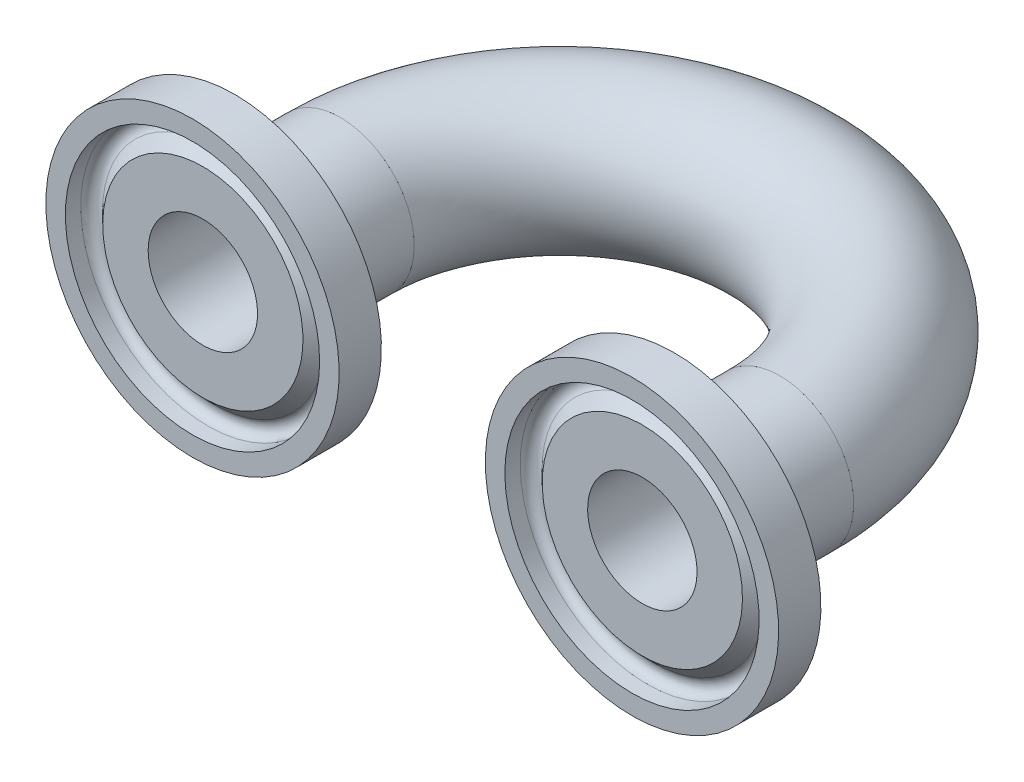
ISO-10303-21;
HEADER;
FILE_DESCRIPTION(('STEP AP214'),'2;1');
FILE_NAME('part.step','',(''),(''),'','','');
FILE_SCHEMA(('AUTOMOTIVE_DESIGN { 1 0 10303 214 1 1 1 1 }'));
ENDSEC;
DATA;
#1=APPLICATION_CONTEXT('core data for automotive mechanical design processes');
#2=APPLICATION_PROTOCOL_DEFINITION('international standard','automotive_design',2000,#1);
#3=PRODUCT_CONTEXT('',#1,'mechanical');
#4=PRODUCT('Part','Part','',(#3));
#5=PRODUCT_RELATED_PRODUCT_CATEGORY('part','',(#4));
#6=PRODUCT_DEFINITION_FORMATION('','',#4);
#7=PRODUCT_DEFINITION_CONTEXT('part definition',#1,'design');
#8=PRODUCT_DEFINITION('design','',#6,#7);
#9=PRODUCT_DEFINITION_SHAPE('','',#8);
#10=(LENGTH_UNIT() NAMED_UNIT(*) SI_UNIT(.MILLI.,.METRE.));
#11=(NAMED_UNIT(*) PLANE_ANGLE_UNIT() SI_UNIT($,.RADIAN.));
#12=(NAMED_UNIT(*) SI_UNIT($,.STERADIAN.) SOLID_ANGLE_UNIT());
#13=UNCERTAINTY_MEASURE_WITH_UNIT(LENGTH_MEASURE(1.E-05),#10,'distance_accuracy_value','');
#14=(GEOMETRIC_REPRESENTATION_CONTEXT(3) GLOBAL_UNCERTAINTY_ASSIGNED_CONTEXT((#13)) GLOBAL_UNIT_ASSIGNED_CONTEXT((#10,
#11,#12)) REPRESENTATION_CONTEXT('',''));
#15=CARTESIAN_POINT('',(0.,0.,0.));
#16=DIRECTION('',(0.,0.,1.));
#17=DIRECTION('',(1.,0.,0.));
#18=AXIS2_PLACEMENT_3D('',#15,#16,#17);
#19=CARTESIAN_POINT('',(33.8741369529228,21.8472242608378,46.9912731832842));
#20=DIRECTION('',(0.,0.,1.));
#21=DIRECTION('',(0.313968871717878,-0.949433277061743,0.));
#22=AXIS2_PLACEMENT_3D('',#19,#20,#21);
#23=CYLINDRICAL_SURFACE('',#22,10.922);
#24=CARTESIAN_POINT('',(33.8741369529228,21.8472242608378,45.6704731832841));
#25=DIRECTION('',(0.,0.,1.));
#26=DIRECTION('',(0.313968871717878,-0.949433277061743,0.));
#27=AXIS2_PLACEMENT_3D('',#24,#25,#26);
#28=CIRCLE('',#27,10.922);
#29=CARTESIAN_POINT('',(37.3033049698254,11.4775140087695,45.6704731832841));
#30=VERTEX_POINT('',#29);
#31=EDGE_CURVE('P0_E9',#30,#30,#28,.T.);
#32=ORIENTED_EDGE('',*,*,#31,.F.);
#33=EDGE_LOOP('',(#32));
#34=FACE_BOUND('',#33,.T.);
#35=CARTESIAN_POINT('',(33.8741369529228,21.8472242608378,46.9912731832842));
#36=DIRECTION('',(0.,0.,1.));
#37=DIRECTION('',(0.313968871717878,-0.949433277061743,0.));
#38=AXIS2_PLACEMENT_3D('',#35,#36,#37);
#39=CIRCLE('',#38,10.922);
#40=CARTESIAN_POINT('',(37.3033049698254,11.4775140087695,46.9912731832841));
#41=VERTEX_POINT('',#40);
#42=EDGE_CURVE('P0_E48',#41,#41,#39,.T.);
#43=ORIENTED_EDGE('',*,*,#42,.T.);
#44=EDGE_LOOP('',(#43));
#45=FACE_BOUND('',#44,.T.);
#46=ADVANCED_FACE('P0_F14',(#34,#45),#23,.F.);
#47=CARTESIAN_POINT('',(33.8741369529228,21.8472242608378,45.6704731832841));
#48=DIRECTION('',(0.,0.,1.));
#49=DIRECTION('',(0.313968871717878,-0.949433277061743,0.));
#50=AXIS2_PLACEMENT_3D('',#47,#48,#49);
#51=TOROIDAL_SURFACE('',#50,10.1473,0.7747);
#52=CARTESIAN_POINT('',(33.8741369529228,21.8472242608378,45.1382742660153));
#53=DIRECTION('',(0.,0.,1.));
#54=DIRECTION('',(0.313968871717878,-0.949433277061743,0.));
#55=AXIS2_PLACEMENT_3D('',#52,#53,#54);
#56=CIRCLE('',#55,9.58433960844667);
#57=CARTESIAN_POINT('',(36.8833212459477,12.7475332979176,45.1382742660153));
#58=VERTEX_POINT('',#57);
#59=EDGE_CURVE('P0_E20',#58,#58,#56,.T.);
#60=ORIENTED_EDGE('',*,*,#59,.F.);
#61=EDGE_LOOP('',(#60));
#62=FACE_BOUND('',#61,.T.);
#63=ORIENTED_EDGE('',*,*,#31,.T.);
#64=EDGE_LOOP('',(#63));
#65=FACE_BOUND('',#64,.T.);
#66=ADVANCED_FACE('P0_F97',(#62,#65),#51,.F.);
#67=CARTESIAN_POINT('',(33.8741369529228,21.8472242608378,45.1382742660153));
#68=DIRECTION('',(0.,0.,-1.));
#69=DIRECTION('',(-0.313968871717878,0.949433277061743,0.));
#70=AXIS2_PLACEMENT_3D('',#67,#68,#69);
#71=CONICAL_SURFACE('',#70,9.58433960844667,0.794623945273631);
#72=CARTESIAN_POINT('',(33.8741369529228,21.8472242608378,46.1022731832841));
#73=DIRECTION('',(0.,0.,1.));
#74=DIRECTION('',(0.313968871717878,-0.949433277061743,0.));
#75=AXIS2_PLACEMENT_3D('',#72,#73,#74);
#76=CIRCLE('',#75,8.60238725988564);
#77=CARTESIAN_POINT('',(36.5750187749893,13.6798315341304,46.1022731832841));
#78=VERTEX_POINT('',#77);
#79=EDGE_CURVE('P0_E24',#78,#78,#76,.T.);
#80=ORIENTED_EDGE('',*,*,#79,.F.);
#81=EDGE_LOOP('',(#80));
#82=FACE_BOUND('',#81,.T.);
#83=ORIENTED_EDGE('',*,*,#59,.T.);
#84=EDGE_LOOP('',(#83));
#85=FACE_BOUND('',#84,.T.);
#86=ADVANCED_FACE('P0_F92',(#82,#85),#71,.T.);
#87=CARTESIAN_POINT('',(25.7067442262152,19.1463424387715,46.1022731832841));
#88=DIRECTION('',(0.,0.,-1.));
#89=DIRECTION('',(-0.313968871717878,0.949433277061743,0.));
#90=AXIS2_PLACEMENT_3D('',#87,#88,#89);
#91=PLANE('',#90);
#92=CARTESIAN_POINT('',(33.8741369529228,21.8472242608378,46.1022731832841));
#93=DIRECTION('',(0.,0.,1.));
#94=DIRECTION('',(0.313968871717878,-0.949433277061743,0.));
#95=AXIS2_PLACEMENT_3D('',#92,#93,#94);
#96=CIRCLE('',#95,4.699);
#97=CARTESIAN_POINT('',(35.3494766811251,17.3858372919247,46.1022731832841));
#98=VERTEX_POINT('',#97);
#99=EDGE_CURVE('P0_E28',#98,#98,#96,.T.);
#100=ORIENTED_EDGE('',*,*,#99,.F.);
#101=EDGE_LOOP('',(#100));
#102=FACE_BOUND('',#101,.T.);
#103=ORIENTED_EDGE('',*,*,#79,.T.);
#104=EDGE_LOOP('',(#103));
#105=FACE_BOUND('',#104,.T.);
#106=ADVANCED_FACE('P0_F86',(#102,#105),#91,.F.);
#107=CARTESIAN_POINT('',(33.8741369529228,21.8472242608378,46.9912731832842));
#108=DIRECTION('',(0.,0.,1.));
#109=DIRECTION('',(0.313968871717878,-0.949433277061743,0.));
#110=AXIS2_PLACEMENT_3D('',#107,#108,#109);
#111=CYLINDRICAL_SURFACE('',#110,4.699);
#112=CARTESIAN_POINT('',(33.8741369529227,21.8472242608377,34.2912731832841));
#113=DIRECTION('',(0.,0.,1.));
#114=DIRECTION('',(0.313968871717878,-0.949433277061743,0.));
#115=AXIS2_PLACEMENT_3D('',#112,#113,#114);
#116=CIRCLE('',#115,4.699);
#117=CARTESIAN_POINT('',(35.349476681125,17.3858372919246,34.2912731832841));
#118=VERTEX_POINT('',#117);
#119=EDGE_CURVE('P0_E33',#118,#118,#116,.T.);
#120=ORIENTED_EDGE('',*,*,#119,.F.);
#121=EDGE_LOOP('',(#120));
#122=FACE_BOUND('',#121,.T.);
#123=ORIENTED_EDGE('',*,*,#99,.T.);
#124=EDGE_LOOP('',(#123));
#125=FACE_BOUND('',#124,.T.);
#126=ADVANCED_FACE('P0_F80',(#122,#125),#111,.F.);
#127=CARTESIAN_POINT('',(29.4127499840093,20.3718845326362,34.2912731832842));
#128=DIRECTION('',(0.,0.,1.));
#129=DIRECTION('',(0.313968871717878,-0.949433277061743,0.));
#130=AXIS2_PLACEMENT_3D('',#127,#128,#129);
#131=PLANE('',#130);
#132=CARTESIAN_POINT('',(33.8741369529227,21.8472242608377,34.2912731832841));
#133=DIRECTION('',(0.,0.,1.));
#134=DIRECTION('',(0.313968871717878,-0.949433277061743,0.));
#135=AXIS2_PLACEMENT_3D('',#132,#133,#134);
#136=CIRCLE('',#135,6.35);
#137=CARTESIAN_POINT('',(35.8678392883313,15.8183229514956,34.2912731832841));
#138=VERTEX_POINT('',#137);
#139=EDGE_CURVE('P0_E36',#138,#138,#136,.T.);
#140=ORIENTED_EDGE('',*,*,#139,.F.);
#141=EDGE_LOOP('',(#140));
#142=FACE_BOUND('',#141,.T.);
#143=ORIENTED_EDGE('',*,*,#119,.T.);
#144=EDGE_LOOP('',(#143));
#145=FACE_BOUND('',#144,.T.);
#146=ADVANCED_FACE('P0_F74',(#142,#145),#131,.F.);
#147=CARTESIAN_POINT('',(33.8741369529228,21.8472242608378,46.9912731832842));
#148=DIRECTION('',(0.,0.,1.));
#149=DIRECTION('',(0.313968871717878,-0.949433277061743,0.));
#150=AXIS2_PLACEMENT_3D('',#147,#148,#149);
#151=CYLINDRICAL_SURFACE('',#150,6.35);
#152=CARTESIAN_POINT('',(33.8741369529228,21.8472242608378,41.0848415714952));
#153=DIRECTION('',(0.,0.,1.));
#154=DIRECTION('',(0.313968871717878,-0.949433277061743,0.));
#155=AXIS2_PLACEMENT_3D('',#152,#153,#154);
#156=CIRCLE('',#155,6.35);
#157=CARTESIAN_POINT('',(35.8678392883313,15.8183229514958,41.0848415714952));
#158=VERTEX_POINT('',#157);
#159=EDGE_CURVE('P0_E39',#158,#158,#156,.T.);
#160=ORIENTED_EDGE('',*,*,#159,.F.);
#161=EDGE_LOOP('',(#160));
#162=FACE_BOUND('',#161,.T.);
#163=ORIENTED_EDGE('',*,*,#139,.T.);
#164=EDGE_LOOP('',(#163));
#165=FACE_BOUND('',#164,.T.);
#166=ADVANCED_FACE('P0_F68',(#162,#165),#151,.T.);
#167=CARTESIAN_POINT('',(33.8741369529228,21.8472242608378,41.0848415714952));
#168=DIRECTION('',(0.,0.,1.));
#169=DIRECTION('',(0.313968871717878,-0.949433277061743,0.));
#170=AXIS2_PLACEMENT_3D('',#167,#168,#169);
#171=CONICAL_SURFACE('',#170,6.35,1.22173047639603);
#172=CARTESIAN_POINT('',(33.8741369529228,21.8472242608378,43.3590731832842));
#173=DIRECTION('',(0.,0.,1.));
#174=DIRECTION('',(0.313968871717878,-0.949433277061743,0.));
#175=AXIS2_PLACEMENT_3D('',#172,#173,#174);
#176=CIRCLE('',#175,12.5984);
#177=CARTESIAN_POINT('',(37.8296423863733,9.88588406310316,43.3590731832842));
#178=VERTEX_POINT('',#177);
#179=EDGE_CURVE('P0_E42',#178,#178,#176,.T.);
#180=ORIENTED_EDGE('',*,*,#179,.F.);
#181=EDGE_LOOP('',(#180));
#182=FACE_BOUND('',#181,.T.);
#183=ORIENTED_EDGE('',*,*,#159,.T.);
#184=EDGE_LOOP('',(#183));
#185=FACE_BOUND('',#184,.T.);
#186=ADVANCED_FACE('P0_F62',(#182,#185),#171,.T.);
#187=CARTESIAN_POINT('',(33.8741369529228,21.8472242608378,46.9912731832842));
#188=DIRECTION('',(0.,0.,1.));
#189=DIRECTION('',(0.313968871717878,-0.949433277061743,0.));
#190=AXIS2_PLACEMENT_3D('',#187,#188,#189);
#191=CYLINDRICAL_SURFACE('',#190,12.5984);
#192=CARTESIAN_POINT('',(33.8741369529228,21.8472242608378,46.9912731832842));
#193=DIRECTION('',(0.,0.,1.));
#194=DIRECTION('',(0.313968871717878,-0.949433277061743,0.));
#195=AXIS2_PLACEMENT_3D('',#192,#193,#194);
#196=CIRCLE('',#195,12.5984);
#197=CARTESIAN_POINT('',(37.8296423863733,9.88588406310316,46.9912731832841));
#198=VERTEX_POINT('',#197);
#199=EDGE_CURVE('P0_E45',#198,#198,#196,.T.);
#200=ORIENTED_EDGE('',*,*,#199,.F.);
#201=EDGE_LOOP('',(#200));
#202=FACE_BOUND('',#201,.T.);
#203=ORIENTED_EDGE('',*,*,#179,.T.);
#204=EDGE_LOOP('',(#203));
#205=FACE_BOUND('',#204,.T.);
#206=ADVANCED_FACE('P0_F56',(#202,#205),#191,.T.);
#207=CARTESIAN_POINT('',(21.912796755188,17.8917188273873,46.9912731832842));
#208=DIRECTION('',(0.,0.,-1.));
#209=DIRECTION('',(-0.313968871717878,0.949433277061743,0.));
#210=AXIS2_PLACEMENT_3D('',#207,#208,#209);
#211=PLANE('',#210);
#212=ORIENTED_EDGE('',*,*,#42,.F.);
#213=EDGE_LOOP('',(#212));
#214=FACE_BOUND('',#213,.T.);
#215=ORIENTED_EDGE('',*,*,#199,.T.);
#216=EDGE_LOOP('',(#215));
#217=FACE_BOUND('',#216,.T.);
#218=ADVANCED_FACE('P0_F53',(#214,#217),#211,.F.);
#219=CLOSED_SHELL('',(#46,#66,#86,#106,#126,#146,#166,#186,#206,#218));
#220=MANIFOLD_SOLID_BREP('P0_B1',#219);
#221=CARTESIAN_POINT('',(-4.22433670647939,21.8472242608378,46.6502382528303));
#222=DIRECTION('',(0.,0.,1.));
#223=DIRECTION('',(0.84551655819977,-0.533949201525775,0.));
#224=AXIS2_PLACEMENT_3D('',#221,#222,#223);
#225=CYLINDRICAL_SURFACE('',#224,10.922);
#226=CARTESIAN_POINT('',(-4.22433670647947,21.8472242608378,45.3294382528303));
#227=DIRECTION('',(0.,0.,1.));
#228=DIRECTION('',(0.84551655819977,-0.533949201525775,0.));
#229=AXIS2_PLACEMENT_3D('',#226,#227,#228);
#230=CIRCLE('',#229,10.922);
#231=CARTESIAN_POINT('',(5.01039514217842,16.0154310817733,45.3294382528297));
#232=VERTEX_POINT('',#231);
#233=EDGE_CURVE('P1_E10',#232,#232,#230,.T.);
#234=ORIENTED_EDGE('',*,*,#233,.F.);
#235=EDGE_LOOP('',(#234));
#236=FACE_BOUND('',#235,.T.);
#237=CARTESIAN_POINT('',(-4.22433670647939,21.8472242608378,46.6502382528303));
#238=DIRECTION('',(0.,0.,1.));
#239=DIRECTION('',(0.84551655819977,-0.533949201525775,0.));
#240=AXIS2_PLACEMENT_3D('',#237,#238,#239);
#241=CIRCLE('',#240,10.922);
#242=CARTESIAN_POINT('',(5.01039514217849,16.0154310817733,46.6502382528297));
#243=VERTEX_POINT('',#242);
#244=EDGE_CURVE('P1_E49',#243,#243,#241,.T.);
#245=ORIENTED_EDGE('',*,*,#244,.T.);
#246=EDGE_LOOP('',(#245));
#247=FACE_BOUND('',#246,.T.);
#248=ADVANCED_FACE('P1_F15',(#236,#247),#225,.F.);
#249=CARTESIAN_POINT('',(-4.22433670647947,21.8472242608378,45.3294382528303));
#250=DIRECTION('',(0.,0.,1.));
#251=DIRECTION('',(0.84551655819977,-0.533949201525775,0.));
#252=AXIS2_PLACEMENT_3D('',#249,#250,#251);
#253=TOROIDAL_SURFACE('',#252,10.1473,0.7747);
#254=CARTESIAN_POINT('',(-4.2243367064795,21.8472242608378,44.7972393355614));
#255=DIRECTION('',(0.,0.,1.));
#256=DIRECTION('',(0.84551655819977,-0.533949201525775,0.));
#257=AXIS2_PLACEMENT_3D('',#254,#255,#256);
#258=CIRCLE('',#257,9.58433960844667);
#259=CARTESIAN_POINT('',(3.87938113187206,16.7296737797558,44.7972393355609));
#260=VERTEX_POINT('',#259);
#261=EDGE_CURVE('P1_E21',#260,#260,#258,.T.);
#262=ORIENTED_EDGE('',*,*,#261,.F.);
#263=EDGE_LOOP('',(#262));
#264=FACE_BOUND('',#263,.T.);
#265=ORIENTED_EDGE('',*,*,#233,.T.);
#266=EDGE_LOOP('',(#265));
#267=FACE_BOUND('',#266,.T.);
#268=ADVANCED_FACE('P1_F98',(#264,#267),#253,.F.);
#269=CARTESIAN_POINT('',(-4.2243367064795,21.8472242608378,44.7972393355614));
#270=DIRECTION('',(0.,0.,-1.));
#271=DIRECTION('',(-0.84551655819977,0.533949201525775,0.));
#272=AXIS2_PLACEMENT_3D('',#269,#270,#271);
#273=CONICAL_SURFACE('',#272,9.58433960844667,0.794623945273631);
#274=CARTESIAN_POINT('',(-4.22433670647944,21.8472242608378,45.7612382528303));
#275=DIRECTION('',(0.,0.,1.));
#276=DIRECTION('',(0.84551655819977,-0.533949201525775,0.));
#277=AXIS2_PLACEMENT_3D('',#274,#275,#276);
#278=CIRCLE('',#277,8.60238725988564);
#279=CARTESIAN_POINT('',(3.04912416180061,17.2539864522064,45.7612382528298));
#280=VERTEX_POINT('',#279);
#281=EDGE_CURVE('P1_E25',#280,#280,#278,.T.);
#282=ORIENTED_EDGE('',*,*,#281,.F.);
#283=EDGE_LOOP('',(#282));
#284=FACE_BOUND('',#283,.T.);
#285=ORIENTED_EDGE('',*,*,#261,.T.);
#286=EDGE_LOOP('',(#285));
#287=FACE_BOUND('',#286,.T.);
#288=ADVANCED_FACE('P1_F93',(#284,#287),#273,.T.);
#289=CARTESIAN_POINT('',(-8.81757451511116,14.5737633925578,45.7612382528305));
#290=DIRECTION('',(0.,0.,-1.));
#291=DIRECTION('',(-0.84551655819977,0.533949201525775,0.));
#292=AXIS2_PLACEMENT_3D('',#289,#290,#291);
#293=PLANE('',#292);
#294=CARTESIAN_POINT('',(-4.22433670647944,21.8472242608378,45.7612382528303));
#295=DIRECTION('',(0.,0.,1.));
#296=DIRECTION('',(0.84551655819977,-0.533949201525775,0.));
#297=AXIS2_PLACEMENT_3D('',#294,#295,#296);
#298=CIRCLE('',#297,4.699);
#299=CARTESIAN_POINT('',(-0.251254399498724,19.3381969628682,45.76123825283));
#300=VERTEX_POINT('',#299);
#301=EDGE_CURVE('P1_E29',#300,#300,#298,.T.);
#302=ORIENTED_EDGE('',*,*,#301,.F.);
#303=EDGE_LOOP('',(#302));
#304=FACE_BOUND('',#303,.T.);
#305=ORIENTED_EDGE('',*,*,#281,.T.);
#306=EDGE_LOOP('',(#305));
#307=FACE_BOUND('',#306,.T.);
#308=ADVANCED_FACE('P1_F87',(#304,#307),#293,.F.);
#309=CARTESIAN_POINT('',(-4.22433670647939,21.8472242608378,46.6502382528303));
#310=DIRECTION('',(0.,0.,1.));
#311=DIRECTION('',(0.84551655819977,-0.533949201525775,0.));
#312=AXIS2_PLACEMENT_3D('',#309,#310,#311);
#313=CYLINDRICAL_SURFACE('',#312,4.699);
#314=CARTESIAN_POINT('',(-4.22433670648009,21.8472242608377,33.9502382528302));
#315=DIRECTION('',(0.,0.,1.));
#316=DIRECTION('',(0.84551655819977,-0.533949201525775,0.));
#317=AXIS2_PLACEMENT_3D('',#314,#315,#316);
#318=CIRCLE('',#317,4.699);
#319=CARTESIAN_POINT('',(-0.251254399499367,19.3381969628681,33.95023825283));
#320=VERTEX_POINT('',#319);
#321=EDGE_CURVE('P1_E34',#320,#320,#318,.T.);
#322=ORIENTED_EDGE('',*,*,#321,.F.);
#323=EDGE_LOOP('',(#322));
#324=FACE_BOUND('',#323,.T.);
#325=ORIENTED_EDGE('',*,*,#301,.T.);
#326=EDGE_LOOP('',(#325));
#327=FACE_BOUND('',#326,.T.);
#328=ADVANCED_FACE('P1_F81',(#324,#327),#313,.F.);
#329=CARTESIAN_POINT('',(-6.73336400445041,17.8741419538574,33.9502382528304));
#330=DIRECTION('',(0.,0.,1.));
#331=DIRECTION('',(0.84551655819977,-0.533949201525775,0.));
#332=AXIS2_PLACEMENT_3D('',#329,#330,#331);
#333=PLANE('',#332);
#334=CARTESIAN_POINT('',(-4.22433670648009,21.8472242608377,33.9502382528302));
#335=DIRECTION('',(0.,0.,1.));
#336=DIRECTION('',(0.84551655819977,-0.533949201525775,0.));
#337=AXIS2_PLACEMENT_3D('',#334,#335,#336);
#338=CIRCLE('',#337,6.35);
#339=CARTESIAN_POINT('',(1.14469343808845,18.456646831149,33.9502382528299));
#340=VERTEX_POINT('',#339);
#341=EDGE_CURVE('P1_E37',#340,#340,#338,.T.);
#342=ORIENTED_EDGE('',*,*,#341,.F.);
#343=EDGE_LOOP('',(#342));
#344=FACE_BOUND('',#343,.T.);
#345=ORIENTED_EDGE('',*,*,#321,.T.);
#346=EDGE_LOOP('',(#345));
#347=FACE_BOUND('',#346,.T.);
#348=ADVANCED_FACE('P1_F75',(#344,#347),#333,.F.);
#349=CARTESIAN_POINT('',(-4.22433670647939,21.8472242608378,46.6502382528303));
#350=DIRECTION('',(0.,0.,1.));
#351=DIRECTION('',(0.84551655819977,-0.533949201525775,0.));
#352=AXIS2_PLACEMENT_3D('',#349,#350,#351);
#353=CYLINDRICAL_SURFACE('',#352,6.35);
#354=CARTESIAN_POINT('',(-4.22433670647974,21.8472242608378,40.7438066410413));
#355=DIRECTION('',(0.,0.,1.));
#356=DIRECTION('',(0.84551655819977,-0.533949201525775,0.));
#357=AXIS2_PLACEMENT_3D('',#354,#355,#356);
#358=CIRCLE('',#357,6.35);
#359=CARTESIAN_POINT('',(1.1446934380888,18.4566468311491,40.743806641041));
#360=VERTEX_POINT('',#359);
#361=EDGE_CURVE('P1_E40',#360,#360,#358,.T.);
#362=ORIENTED_EDGE('',*,*,#361,.F.);
#363=EDGE_LOOP('',(#362));
#364=FACE_BOUND('',#363,.T.);
#365=ORIENTED_EDGE('',*,*,#341,.T.);
#366=EDGE_LOOP('',(#365));
#367=FACE_BOUND('',#366,.T.);
#368=ADVANCED_FACE('P1_F69',(#364,#367),#353,.T.);
#369=CARTESIAN_POINT('',(-4.22433670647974,21.8472242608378,40.7438066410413));
#370=DIRECTION('',(0.,0.,1.));
#371=DIRECTION('',(0.84551655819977,-0.533949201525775,0.));
#372=AXIS2_PLACEMENT_3D('',#369,#370,#371);
#373=CONICAL_SURFACE('',#372,6.35,1.22173047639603);
#374=CARTESIAN_POINT('',(-4.22433670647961,21.8472242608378,43.0180382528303));
#375=DIRECTION('',(0.,0.,1.));
#376=DIRECTION('',(0.84551655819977,-0.533949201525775,0.));
#377=AXIS2_PLACEMENT_3D('',#374,#375,#376);
#378=CIRCLE('',#377,12.5984);
#379=CARTESIAN_POINT('',(6.42781910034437,15.1203186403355,43.0180382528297));
#380=VERTEX_POINT('',#379);
#381=EDGE_CURVE('P1_E43',#380,#380,#378,.T.);
#382=ORIENTED_EDGE('',*,*,#381,.F.);
#383=EDGE_LOOP('',(#382));
#384=FACE_BOUND('',#383,.T.);
#385=ORIENTED_EDGE('',*,*,#361,.T.);
#386=EDGE_LOOP('',(#385));
#387=FACE_BOUND('',#386,.T.);
#388=ADVANCED_FACE('P1_F63',(#384,#387),#373,.T.);
#389=CARTESIAN_POINT('',(-4.22433670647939,21.8472242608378,46.6502382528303));
#390=DIRECTION('',(0.,0.,1.));
#391=DIRECTION('',(0.84551655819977,-0.533949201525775,0.));
#392=AXIS2_PLACEMENT_3D('',#389,#390,#391);
#393=CYLINDRICAL_SURFACE('',#392,12.5984);
#394=CARTESIAN_POINT('',(-4.22433670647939,21.8472242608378,46.6502382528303));
#395=DIRECTION('',(0.,0.,1.));
#396=DIRECTION('',(0.84551655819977,-0.533949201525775,0.));
#397=AXIS2_PLACEMENT_3D('',#394,#395,#396);
#398=CIRCLE('',#397,12.5984);
#399=CARTESIAN_POINT('',(6.42781910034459,15.1203186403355,46.6502382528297));
#400=VERTEX_POINT('',#399);
#401=EDGE_CURVE('P1_E46',#400,#400,#398,.T.);
#402=ORIENTED_EDGE('',*,*,#401,.F.);
#403=EDGE_LOOP('',(#402));
#404=FACE_BOUND('',#403,.T.);
#405=ORIENTED_EDGE('',*,*,#381,.T.);
#406=EDGE_LOOP('',(#405));
#407=FACE_BOUND('',#406,.T.);
#408=ADVANCED_FACE('P1_F57',(#404,#407),#393,.T.);
#409=CARTESIAN_POINT('',(-10.9512423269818,11.1950684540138,46.6502382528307));
#410=DIRECTION('',(0.,0.,-1.));
#411=DIRECTION('',(-0.84551655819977,0.533949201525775,0.));
#412=AXIS2_PLACEMENT_3D('',#409,#410,#411);
#413=PLANE('',#412);
#414=ORIENTED_EDGE('',*,*,#244,.F.);
#415=EDGE_LOOP('',(#414));
#416=FACE_BOUND('',#415,.T.);
#417=ORIENTED_EDGE('',*,*,#401,.T.);
#418=EDGE_LOOP('',(#417));
#419=FACE_BOUND('',#418,.T.);
#420=ADVANCED_FACE('P1_F54',(#416,#419),#413,.F.);
#421=CLOSED_SHELL('',(#248,#268,#288,#308,#328,#348,#368,#388,#408,#420));
#422=MANIFOLD_SOLID_BREP('P1_B1',#421);
#423=CARTESIAN_POINT('',(-4.22433670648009,21.8472242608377,33.9502382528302));
#424=DIRECTION('',(0.,0.,-1.));
#425=DIRECTION('',(-1.,0.,0.));
#426=AXIS2_PLACEMENT_3D('',#423,#424,#425);
#427=CIRCLE('',#426,6.35);
#428=CARTESIAN_POINT('',(14.8249001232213,21.8472242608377,34.1207557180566));
#429=DIRECTION('',(0.,-1.,0.));
#430=AXIS1_PLACEMENT('',#428,#429);
#431=SURFACE_OF_REVOLUTION('',#427,#430);
#432=CARTESIAN_POINT('',(-10.5743367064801,21.8472242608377,33.9502382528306));
#433=VERTEX_POINT('',#432);
#434=EDGE_CURVE('P2_E10',#433,#433,#427,.T.);
#435=ORIENTED_EDGE('',*,*,#434,.T.);
#436=EDGE_LOOP('',(#435));
#437=FACE_BOUND('',#436,.T.);
#438=CARTESIAN_POINT('',(33.8741369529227,21.8472242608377,34.2912731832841));
#439=DIRECTION('',(0.,0.,1.));
#440=DIRECTION('',(1.,0.,0.));
#441=AXIS2_PLACEMENT_3D('',#438,#439,#440);
#442=CIRCLE('',#441,6.35);
#443=CARTESIAN_POINT('',(40.2241369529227,21.8472242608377,34.2912731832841));
#444=VERTEX_POINT('',#443);
#445=EDGE_CURVE('P2_E22',#444,#444,#442,.T.);
#446=ORIENTED_EDGE('',*,*,#445,.F.);
#447=EDGE_LOOP('',(#446));
#448=FACE_BOUND('',#447,.T.);
#449=ADVANCED_FACE('P2_F15',(#437,#448),#431,.F.);
#450=CARTESIAN_POINT('',(-4.22433670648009,21.8472242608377,33.9502382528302));
#451=DIRECTION('',(0.,0.,-1.));
#452=DIRECTION('',(-1.,0.,0.));
#453=AXIS2_PLACEMENT_3D('',#450,#451,#452);
#454=PLANE('',#453);
#455=CARTESIAN_POINT('',(0.474531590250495,21.8472242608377,33.95023825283));
#456=CARTESIAN_POINT('',(0.474519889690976,21.5832711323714,33.95023825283));
#457=CARTESIAN_POINT('',(0.452217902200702,21.3191266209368,33.9502382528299));
#458=CARTESIAN_POINT('',(0.363559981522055,20.7981120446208,33.95023825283));
#459=CARTESIAN_POINT('',(0.297151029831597,20.5412511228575,33.95023825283));
#460=CARTESIAN_POINT('',(0.122168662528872,20.042427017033,33.95023825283));
#461=CARTESIAN_POINT('',(0.0136153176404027,19.8004568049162,33.95023825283));
#462=CARTESIAN_POINT('',(-0.242547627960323,19.3382440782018,33.95023825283));
#463=CARTESIAN_POINT('',(-0.390147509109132,19.117996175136,33.95023825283));
#464=CARTESIAN_POINT('',(-0.720238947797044,18.7053868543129,33.95023825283));
#465=CARTESIAN_POINT('',(-0.902733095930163,18.5130275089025,33.95023825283));
#466=CARTESIAN_POINT('',(-1.29743385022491,18.1616716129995,33.95023825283));
#467=CARTESIAN_POINT('',(-1.5096416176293,18.0026763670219,33.9502382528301));
#468=CARTESIAN_POINT('',(-1.95772693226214,17.722579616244,33.9502382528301));
#469=CARTESIAN_POINT('',(-2.19360314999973,17.6014759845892,33.9502382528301));
#470=CARTESIAN_POINT('',(-2.68233886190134,17.4005885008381,33.9502382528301));
#471=CARTESIAN_POINT('',(-2.93519832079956,17.3208045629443,33.9502382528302));
#472=CARTESIAN_POINT('',(-3.45072132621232,17.2048210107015,33.9502382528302));
#473=CARTESIAN_POINT('',(-3.713384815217,17.1686211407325,33.9502382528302));
#474=CARTESIAN_POINT('',(-4.24106064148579,17.1408321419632,33.9502382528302));
#475=CARTESIAN_POINT('',(-4.50607297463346,17.1492429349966,33.9502382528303));
#476=CARTESIAN_POINT('',(-5.03092758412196,17.2104363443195,33.9502382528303));
#477=CARTESIAN_POINT('',(-5.29076979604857,17.2632195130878,33.9502382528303));
#478=CARTESIAN_POINT('',(-5.79790514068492,17.4116598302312,33.9502382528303));
#479=CARTESIAN_POINT('',(-6.04519825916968,17.5073170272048,33.9502382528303));
#480=CARTESIAN_POINT('',(-6.520219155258,17.7387915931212,33.9502382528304));
#481=CARTESIAN_POINT('',(-6.74794663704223,17.8746095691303,33.9502382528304));
#482=CARTESIAN_POINT('',(-7.17736769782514,18.1825495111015,33.9502382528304));
#483=CARTESIAN_POINT('',(-7.37906128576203,18.3546714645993,33.9502382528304));
#484=CARTESIAN_POINT('',(-7.75069152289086,18.7303354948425,33.9502382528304));
#485=CARTESIAN_POINT('',(-7.92062781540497,18.933877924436,33.9502382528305));
#486=CARTESIAN_POINT('',(-8.22391681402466,19.3666035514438,33.9502382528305));
#487=CARTESIAN_POINT('',(-8.35726951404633,19.5957867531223,33.9502382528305));
#488=CARTESIAN_POINT('',(-8.58360659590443,20.0732895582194,33.9502382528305));
#489=CARTESIAN_POINT('',(-8.67659073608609,20.3216092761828,33.9502382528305));
#490=CARTESIAN_POINT('',(-8.81955003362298,20.8303348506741,33.9502382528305));
#491=CARTESIAN_POINT('',(-8.86952519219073,21.0907407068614,33.9502382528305));
#492=CARTESIAN_POINT('',(-8.92504798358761,21.6162471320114,33.9502382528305));
#493=CARTESIAN_POINT('',(-8.93059550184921,21.8813477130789,33.9502382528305));
#494=CARTESIAN_POINT('',(-8.897105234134,22.4087175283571,33.9502382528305));
#495=CARTESIAN_POINT('',(-8.85806744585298,22.6709867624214,33.9502382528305));
#496=CARTESIAN_POINT('',(-8.73651467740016,23.1852489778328,33.9502382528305));
#497=CARTESIAN_POINT('',(-8.65399967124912,23.4372419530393,33.9502382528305));
#498=CARTESIAN_POINT('',(-8.44783479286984,23.9237980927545,33.9502382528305));
#499=CARTESIAN_POINT('',(-8.32418492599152,24.15836125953,33.9502382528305));
#500=CARTESIAN_POINT('',(-8.03926050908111,24.6033989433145,33.9502382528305));
#501=CARTESIAN_POINT('',(-7.87798600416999,24.8138734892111,33.9502382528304));
#502=CARTESIAN_POINT('',(-7.52239020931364,25.2047594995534,33.9502382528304));
#503=CARTESIAN_POINT('',(-7.32806890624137,25.3851709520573,33.9502382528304));
#504=CARTESIAN_POINT('',(-6.91189637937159,25.7108086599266,33.9502382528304));
#505=CARTESIAN_POINT('',(-6.69004524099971,25.8560350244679,33.9502382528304));
#506=CARTESIAN_POINT('',(-6.22511047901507,26.1071803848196,33.9502382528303));
#507=CARTESIAN_POINT('',(-5.98202687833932,26.2130994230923,33.9502382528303));
#508=CARTESIAN_POINT('',(-5.4815294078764,26.3826226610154,33.9502382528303));
#509=CARTESIAN_POINT('',(-5.22411564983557,26.4462271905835,33.9502382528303));
#510=CARTESIAN_POINT('',(-4.70226293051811,26.5293169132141,33.9502382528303));
#511=CARTESIAN_POINT('',(-4.437823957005,26.5488020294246,33.9502382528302));
#512=CARTESIAN_POINT('',(-3.90943201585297,26.5430992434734,33.9502382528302));
#513=CARTESIAN_POINT('',(-3.64547904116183,26.5179119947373,33.9502382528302));
#514=CARTESIAN_POINT('',(-3.12554775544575,26.423580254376,33.9502382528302));
#515=CARTESIAN_POINT('',(-2.86956945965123,26.3544356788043,33.9502382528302));
#516=CARTESIAN_POINT('',(-2.37285421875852,26.1741517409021,33.9502382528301));
#517=CARTESIAN_POINT('',(-2.13211731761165,26.0630122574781,33.9502382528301));
#518=CARTESIAN_POINT('',(-1.67272890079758,25.8018980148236,33.9502382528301));
#519=CARTESIAN_POINT('',(-1.45407651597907,25.6519247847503,33.95023825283));
#520=CARTESIAN_POINT('',(-1.04507637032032,25.3174197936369,33.95023825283));
#521=CARTESIAN_POINT('',(-0.854725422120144,25.1328919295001,33.95023825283));
#522=CARTESIAN_POINT('',(-0.507656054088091,24.7344449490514,33.95023825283));
#523=CARTESIAN_POINT('',(-0.350946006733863,24.5205185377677,33.95023825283));
#524=CARTESIAN_POINT('',(-0.0756025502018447,24.0693062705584,33.95023825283));
#525=CARTESIAN_POINT('',(0.0430119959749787,23.8320089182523,33.95023825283));
#526=CARTESIAN_POINT('',(0.238584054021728,23.3410552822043,33.95023825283));
#527=CARTESIAN_POINT('',(0.31559148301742,23.0874190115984,33.95023825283));
#528=CARTESIAN_POINT('',(0.40524226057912,22.6680097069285,33.95023825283));
#529=CARTESIAN_POINT('',(0.431193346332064,22.5049613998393,33.95023825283));
#530=CARTESIAN_POINT('',(0.465841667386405,22.1770417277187,33.95023825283));
#531=CARTESIAN_POINT('',(0.474538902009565,22.0121703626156,33.95023825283));
#532=CARTESIAN_POINT('',(0.474531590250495,21.8472242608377,33.95023825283));
#533=B_SPLINE_CURVE_WITH_KNOTS('',3,(#455,#456,#457,#458,#459,#460,#461,#462,#463,#464,#465,
#466,#467,#468,#469,#470,#471,#472,#473,#474,#475,#476,#477,#478,#479,#480,#481,#482,#483,#484,
#485,#486,#487,#488,#489,#490,#491,#492,#493,#494,#495,#496,#497,#498,#499,#500,#501,#502,#503,
#504,#505,#506,#507,#508,#509,#510,#511,#512,#513,#514,#515,#516,#517,#518,#519,#520,#521,#522,
#523,#524,#525,#526,#527,#528,#529,#530,#531,#532),.UNSPECIFIED.,.T.,.F.,(4,2,2,2,2,2,2,2,2,2,2,
2,2,2,2,2,2,2,2,2,2,2,2,2,2,2,2,2,2,2,2,2,2,2,2,2,2,2,4),(0.,0.791257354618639,1.58346756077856,
2.37530094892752,3.16693741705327,3.95863268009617,4.75035889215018,5.54204065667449,
6.33372077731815,7.12539625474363,7.91707034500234,8.70875429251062,9.50043913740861,
10.2921359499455,11.0838324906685,11.8755379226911,12.6672434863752,13.458953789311,
14.2506640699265,15.0423763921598,15.8340887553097,16.6258015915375,17.4175143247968,
18.2092261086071,19.0009382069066,19.7926478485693,20.5843566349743,21.3760592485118,
22.1677632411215,22.959455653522,23.7511495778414,24.5428457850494,25.3345108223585,
26.1260866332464,26.9178592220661,27.7100232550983,28.5012347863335,28.9956968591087,
29.4901589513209),.UNSPECIFIED.);
#534=CARTESIAN_POINT('',(0.474531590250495,21.8472242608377,33.95023825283));
#535=VERTEX_POINT('',#534);
#536=EDGE_CURVE('P2_E26',#535,#535,#533,.T.);
#537=ORIENTED_EDGE('',*,*,#536,.T.);
#538=EDGE_LOOP('',(#537));
#539=FACE_BOUND('',#538,.T.);
#540=ORIENTED_EDGE('',*,*,#434,.F.);
#541=EDGE_LOOP('',(#540));
#542=FACE_BOUND('',#541,.T.);
#543=ADVANCED_FACE('P2_F53',(#539,#542),#454,.F.);
#544=CARTESIAN_POINT('',(33.8741369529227,21.8472242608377,34.2912731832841));
#545=DIRECTION('',(0.,0.,1.));
#546=DIRECTION('',(1.,0.,0.));
#547=AXIS2_PLACEMENT_3D('',#544,#545,#546);
#548=PLANE('',#547);
#549=CARTESIAN_POINT('',(29.1752686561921,21.8472242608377,34.2912731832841));
#550=CARTESIAN_POINT('',(29.1752803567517,21.5832711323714,34.2912731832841));
#551=CARTESIAN_POINT('',(29.1975823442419,21.3191266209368,34.2912731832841));
#552=CARTESIAN_POINT('',(29.2862402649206,20.7981120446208,34.2912731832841));
#553=CARTESIAN_POINT('',(29.352649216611,20.5412511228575,34.2912731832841));
#554=CARTESIAN_POINT('',(29.5276315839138,20.042427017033,34.2912731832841));
#555=CARTESIAN_POINT('',(29.6361849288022,19.8004568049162,34.2912731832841));
#556=CARTESIAN_POINT('',(29.892347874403,19.3382440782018,34.2912731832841));
#557=CARTESIAN_POINT('',(30.0399477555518,19.117996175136,34.2912731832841));
#558=CARTESIAN_POINT('',(30.3700391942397,18.7053868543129,34.2912731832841));
#559=CARTESIAN_POINT('',(30.5525333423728,18.5130275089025,34.2912731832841));
#560=CARTESIAN_POINT('',(30.9472340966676,18.1616716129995,34.2912731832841));
#561=CARTESIAN_POINT('',(31.159441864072,18.0026763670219,34.2912731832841));
#562=CARTESIAN_POINT('',(31.6075271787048,17.722579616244,34.2912731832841));
#563=CARTESIAN_POINT('',(31.8434033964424,17.6014759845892,34.2912731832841));
#564=CARTESIAN_POINT('',(32.332139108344,17.4005885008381,34.2912731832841));
#565=CARTESIAN_POINT('',(32.5849985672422,17.3208045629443,34.2912731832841));
#566=CARTESIAN_POINT('',(33.100521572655,17.2048210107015,34.2912731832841));
#567=CARTESIAN_POINT('',(33.3631850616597,17.1686211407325,34.2912731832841));
#568=CARTESIAN_POINT('',(33.8908608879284,17.1408321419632,34.2912731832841));
#569=CARTESIAN_POINT('',(34.1558732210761,17.1492429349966,34.2912731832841));
#570=CARTESIAN_POINT('',(34.6807278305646,17.2104363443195,34.2912731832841));
#571=CARTESIAN_POINT('',(34.9405700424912,17.2632195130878,34.2912731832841));
#572=CARTESIAN_POINT('',(35.4477053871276,17.4116598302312,34.2912731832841));
#573=CARTESIAN_POINT('',(35.6949985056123,17.5073170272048,34.2912731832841));
#574=CARTESIAN_POINT('',(36.1700194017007,17.7387915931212,34.2912731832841));
#575=CARTESIAN_POINT('',(36.3977468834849,17.8746095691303,34.2912731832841));
#576=CARTESIAN_POINT('',(36.8271679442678,18.1825495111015,34.2912731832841));
#577=CARTESIAN_POINT('',(37.0288615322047,18.3546714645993,34.2912731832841));
#578=CARTESIAN_POINT('',(37.4004917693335,18.7303354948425,34.2912731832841));
#579=CARTESIAN_POINT('',(37.5704280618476,18.933877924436,34.2912731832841));
#580=CARTESIAN_POINT('',(37.8737170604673,19.3666035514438,34.2912731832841));
#581=CARTESIAN_POINT('',(38.007069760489,19.5957867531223,34.2912731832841));
#582=CARTESIAN_POINT('',(38.2334068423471,20.0732895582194,34.2912731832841));
#583=CARTESIAN_POINT('',(38.3263909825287,20.3216092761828,34.2912731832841));
#584=CARTESIAN_POINT('',(38.4693502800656,20.8303348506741,34.2912731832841));
#585=CARTESIAN_POINT('',(38.5193254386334,21.0907407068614,34.2912731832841));
#586=CARTESIAN_POINT('',(38.5748482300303,21.6162471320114,34.2912731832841));
#587=CARTESIAN_POINT('',(38.5803957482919,21.8813477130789,34.2912731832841));
#588=CARTESIAN_POINT('',(38.5469054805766,22.4087175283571,34.2912731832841));
#589=CARTESIAN_POINT('',(38.5078676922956,22.6709867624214,34.2912731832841));
#590=CARTESIAN_POINT('',(38.3863149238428,23.1852489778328,34.2912731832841));
#591=CARTESIAN_POINT('',(38.3037999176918,23.4372419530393,34.2912731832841));
#592=CARTESIAN_POINT('',(38.0976350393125,23.9237980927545,34.2912731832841));
#593=CARTESIAN_POINT('',(37.9739851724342,24.15836125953,34.2912731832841));
#594=CARTESIAN_POINT('',(37.6890607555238,24.6033989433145,34.2912731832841));
#595=CARTESIAN_POINT('',(37.5277862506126,24.8138734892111,34.2912731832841));
#596=CARTESIAN_POINT('',(37.1721904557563,25.2047594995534,34.2912731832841));
#597=CARTESIAN_POINT('',(36.977869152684,25.3851709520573,34.2912731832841));
#598=CARTESIAN_POINT('',(36.5616966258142,25.7108086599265,34.2912731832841));
#599=CARTESIAN_POINT('',(36.3398454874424,25.8560350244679,34.2912731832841));
#600=CARTESIAN_POINT('',(35.8749107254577,26.1071803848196,34.2912731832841));
#601=CARTESIAN_POINT('',(35.631827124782,26.2130994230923,34.2912731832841));
#602=CARTESIAN_POINT('',(35.131329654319,26.3826226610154,34.2912731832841));
#603=CARTESIAN_POINT('',(34.8739158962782,26.4462271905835,34.2912731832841));
#604=CARTESIAN_POINT('',(34.3520631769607,26.5293169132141,34.2912731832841));
#605=CARTESIAN_POINT('',(34.0876242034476,26.5488020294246,34.2912731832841));
#606=CARTESIAN_POINT('',(33.5592322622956,26.5430992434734,34.2912731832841));
#607=CARTESIAN_POINT('',(33.2952792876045,26.5179119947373,34.2912731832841));
#608=CARTESIAN_POINT('',(32.7753480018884,26.423580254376,34.2912731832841));
#609=CARTESIAN_POINT('',(32.5193697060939,26.3544356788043,34.2912731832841));
#610=CARTESIAN_POINT('',(32.0226544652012,26.1741517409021,34.2912731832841));
#611=CARTESIAN_POINT('',(31.7819175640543,26.0630122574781,34.2912731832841));
#612=CARTESIAN_POINT('',(31.3225291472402,25.8018980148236,34.2912731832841));
#613=CARTESIAN_POINT('',(31.1038767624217,25.6519247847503,34.2912731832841));
#614=CARTESIAN_POINT('',(30.694876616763,25.3174197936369,34.2912731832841));
#615=CARTESIAN_POINT('',(30.5045256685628,25.1328919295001,34.2912731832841));
#616=CARTESIAN_POINT('',(30.1574563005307,24.7344449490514,34.2912731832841));
#617=CARTESIAN_POINT('',(30.0007462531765,24.5205185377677,34.2912731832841));
#618=CARTESIAN_POINT('',(29.7254027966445,24.0693062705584,34.2912731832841));
#619=CARTESIAN_POINT('',(29.6067882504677,23.8320089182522,34.2912731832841));
#620=CARTESIAN_POINT('',(29.4112161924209,23.3410552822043,34.2912731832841));
#621=CARTESIAN_POINT('',(29.3342087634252,23.0874190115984,34.2912731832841));
#622=CARTESIAN_POINT('',(29.2445579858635,22.6680097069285,34.2912731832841));
#623=CARTESIAN_POINT('',(29.2186069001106,22.5049613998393,34.2912731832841));
#624=CARTESIAN_POINT('',(29.1839585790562,22.1770417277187,34.2912731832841));
#625=CARTESIAN_POINT('',(29.1752613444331,22.0121703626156,34.2912731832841));
#626=CARTESIAN_POINT('',(29.1752686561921,21.8472242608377,34.2912731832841));
#627=B_SPLINE_CURVE_WITH_KNOTS('',3,(#549,#550,#551,#552,#553,#554,#555,#556,#557,#558,#559,
#560,#561,#562,#563,#564,#565,#566,#567,#568,#569,#570,#571,#572,#573,#574,#575,#576,#577,#578,
#579,#580,#581,#582,#583,#584,#585,#586,#587,#588,#589,#590,#591,#592,#593,#594,#595,#596,#597,
#598,#599,#600,#601,#602,#603,#604,#605,#606,#607,#608,#609,#610,#611,#612,#613,#614,#615,#616,
#617,#618,#619,#620,#621,#622,#623,#624,#625,#626),.UNSPECIFIED.,.T.,.F.,(4,2,2,2,2,2,2,2,2,2,2,
2,2,2,2,2,2,2,2,2,2,2,2,2,2,2,2,2,2,2,2,2,2,2,2,2,2,2,4),(0.,0.791257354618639,1.58346756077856,
2.37530094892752,3.16693741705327,3.95863268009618,4.75035889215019,5.5420406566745,
6.33372077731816,7.12539625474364,7.91707034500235,8.70875429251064,9.50043913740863,
10.2921359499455,11.0838324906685,11.8755379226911,12.6672434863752,13.458953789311,
14.2506640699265,15.0423763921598,15.8340887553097,16.6258015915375,17.4175143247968,
18.2092261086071,19.0009382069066,19.7926478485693,20.5843566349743,21.3760592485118,
22.1677632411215,22.959455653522,23.7511495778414,24.5428457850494,25.3345108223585,
26.1260866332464,26.9178592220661,27.7100232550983,28.5012347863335,28.9956968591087,
29.4901589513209),.UNSPECIFIED.);
#628=CARTESIAN_POINT('',(29.1752686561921,21.8472242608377,34.2912731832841));
#629=VERTEX_POINT('',#628);
#630=EDGE_CURVE('P2_E30',#629,#629,#627,.T.);
#631=ORIENTED_EDGE('',*,*,#630,.F.);
#632=EDGE_LOOP('',(#631));
#633=FACE_BOUND('',#632,.T.);
#634=ORIENTED_EDGE('',*,*,#445,.T.);
#635=EDGE_LOOP('',(#634));
#636=FACE_BOUND('',#635,.T.);
#637=ADVANCED_FACE('P2_F48',(#633,#636),#548,.T.);
#638=CARTESIAN_POINT('',(-4.22433670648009,21.8472242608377,33.9502382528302));
#639=DIRECTION('',(0.,0.,-1.));
#640=DIRECTION('',(-1.,0.,0.));
#641=AXIS2_PLACEMENT_3D('',#638,#639,#640);
#642=CIRCLE('',#641,6.35);
#643=CARTESIAN_POINT('',(14.8249001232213,21.8472242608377,34.1207557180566));
#644=DIRECTION('',(0.,-1.,0.));
#645=AXIS1_PLACEMENT('',#643,#644);
#646=SURFACE_OF_REVOLUTION('',#642,#645);
#647=OFFSET_SURFACE('',#646,1.651,.F.);
#648=ORIENTED_EDGE('',*,*,#536,.F.);
#649=EDGE_LOOP('',(#648));
#650=FACE_BOUND('',#649,.T.);
#651=ORIENTED_EDGE('',*,*,#630,.T.);
#652=EDGE_LOOP('',(#651));
#653=FACE_BOUND('',#652,.T.);
#654=ADVANCED_FACE('P2_F43',(#650,#653),#647,.T.);
#655=CLOSED_SHELL('',(#449,#543,#637,#654));
#656=MANIFOLD_SOLID_BREP('P2_B1',#655);
#657=ADVANCED_BREP_SHAPE_REPRESENTATION('',(#18,#220,#422,#656),#14);
#658=SHAPE_DEFINITION_REPRESENTATION(#9,#657);
ENDSEC;
END-ISO-10303-21;
